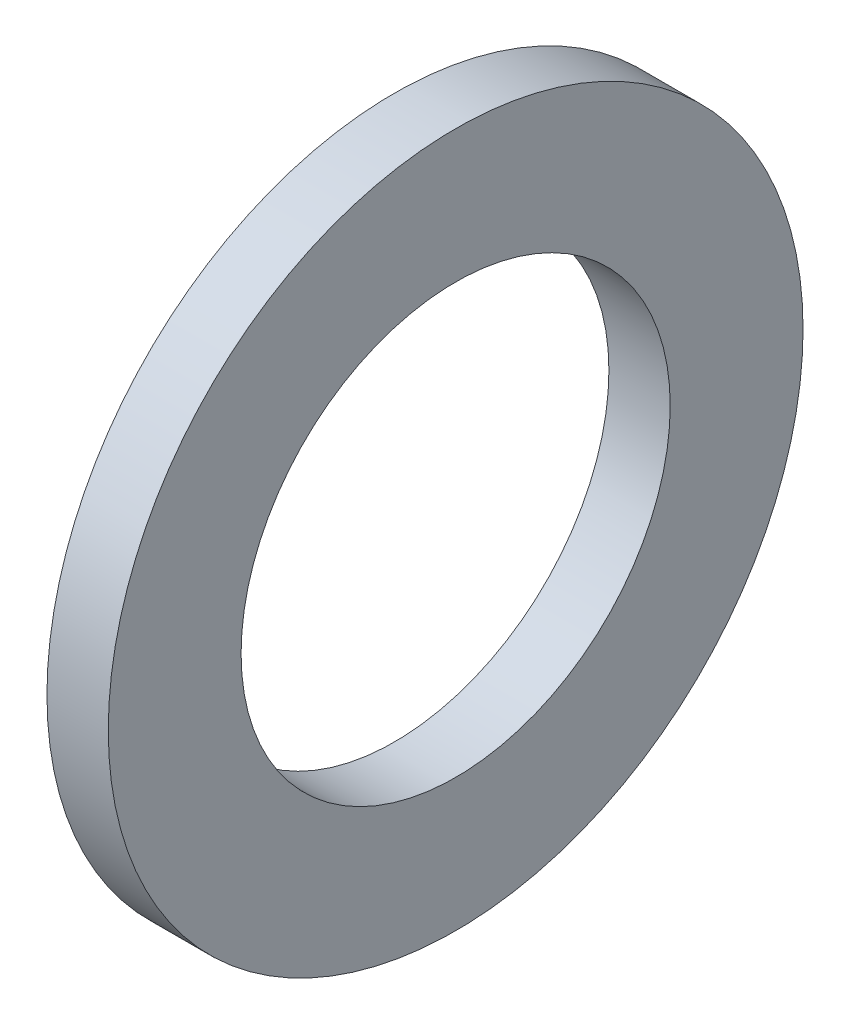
ISO-10303-21;
HEADER;
FILE_DESCRIPTION(('STEP AP214'),'2;1');
FILE_NAME('part.step','',(''),(''),'','','');
FILE_SCHEMA(('AUTOMOTIVE_DESIGN { 1 0 10303 214 1 1 1 1 }'));
ENDSEC;
DATA;
#1=APPLICATION_CONTEXT('core data for automotive mechanical design processes');
#2=APPLICATION_PROTOCOL_DEFINITION('international standard','automotive_design',2000,#1);
#3=PRODUCT_CONTEXT('',#1,'mechanical');
#4=PRODUCT('Part','Part','',(#3));
#5=PRODUCT_RELATED_PRODUCT_CATEGORY('part','',(#4));
#6=PRODUCT_DEFINITION_FORMATION('','',#4);
#7=PRODUCT_DEFINITION_CONTEXT('part definition',#1,'design');
#8=PRODUCT_DEFINITION('design','',#6,#7);
#9=PRODUCT_DEFINITION_SHAPE('','',#8);
#10=(LENGTH_UNIT() NAMED_UNIT(*) SI_UNIT(.MILLI.,.METRE.));
#11=(NAMED_UNIT(*) PLANE_ANGLE_UNIT() SI_UNIT($,.RADIAN.));
#12=(NAMED_UNIT(*) SI_UNIT($,.STERADIAN.) SOLID_ANGLE_UNIT());
#13=UNCERTAINTY_MEASURE_WITH_UNIT(LENGTH_MEASURE(1.E-05),#10,'distance_accuracy_value','');
#14=(GEOMETRIC_REPRESENTATION_CONTEXT(3) GLOBAL_UNCERTAINTY_ASSIGNED_CONTEXT((#13)) GLOBAL_UNIT_ASSIGNED_CONTEXT((#10,
#11,#12)) REPRESENTATION_CONTEXT('',''));
#15=CARTESIAN_POINT('',(0.,0.,0.));
#16=DIRECTION('',(0.,0.,1.));
#17=DIRECTION('',(1.,0.,0.));
#18=AXIS2_PLACEMENT_3D('',#15,#16,#17);
#19=CARTESIAN_POINT('',(-34.9249999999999,0.,0.));
#20=DIRECTION('',(-1.,0.,0.));
#21=DIRECTION('',(0.,0.,1.));
#22=AXIS2_PLACEMENT_3D('',#19,#20,#21);
#23=CYLINDRICAL_SURFACE('',#22,10.5);
#24=CARTESIAN_POINT('',(0.,0.,0.));
#25=DIRECTION('',(-1.,0.,0.));
#26=DIRECTION('',(0.,0.,1.));
#27=AXIS2_PLACEMENT_3D('',#24,#25,#26);
#28=CIRCLE('',#27,10.5);
#29=CARTESIAN_POINT('',(0.,0.,10.5));
#30=VERTEX_POINT('',#29);
#31=EDGE_CURVE('E10',#30,#30,#28,.T.);
#32=ORIENTED_EDGE('',*,*,#31,.F.);
#33=EDGE_LOOP('',(#32));
#34=FACE_BOUND('',#33,.T.);
#35=CARTESIAN_POINT('',(-3.,0.,0.));
#36=DIRECTION('',(-1.,0.,0.));
#37=DIRECTION('',(0.,0.,1.));
#38=AXIS2_PLACEMENT_3D('',#35,#36,#37);
#39=CIRCLE('',#38,10.5);
#40=CARTESIAN_POINT('',(-3.,0.,10.5));
#41=VERTEX_POINT('',#40);
#42=EDGE_CURVE('E45',#41,#41,#39,.T.);
#43=ORIENTED_EDGE('',*,*,#42,.T.);
#44=EDGE_LOOP('',(#43));
#45=FACE_BOUND('',#44,.T.);
#46=ADVANCED_FACE('F31',(#34,#45),#23,.F.);
#47=CARTESIAN_POINT('',(0.,10.5,0.));
#48=DIRECTION('',(-1.,0.,0.));
#49=DIRECTION('',(0.,0.,1.));
#50=AXIS2_PLACEMENT_3D('',#47,#48,#49);
#51=PLANE('',#50);
#52=CARTESIAN_POINT('',(0.,0.,0.));
#53=DIRECTION('',(-1.,0.,0.));
#54=DIRECTION('',(0.,0.,1.));
#55=AXIS2_PLACEMENT_3D('',#52,#53,#54);
#56=CIRCLE('',#55,17.);
#57=CARTESIAN_POINT('',(0.,0.,17.));
#58=VERTEX_POINT('',#57);
#59=EDGE_CURVE('E37',#58,#58,#56,.T.);
#60=ORIENTED_EDGE('',*,*,#59,.F.);
#61=EDGE_LOOP('',(#60));
#62=FACE_BOUND('',#61,.T.);
#63=ORIENTED_EDGE('',*,*,#31,.T.);
#64=EDGE_LOOP('',(#63));
#65=FACE_BOUND('',#64,.T.);
#66=ADVANCED_FACE('F60',(#62,#65),#51,.F.);
#67=CARTESIAN_POINT('',(-34.9249999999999,0.,0.));
#68=DIRECTION('',(-1.,0.,0.));
#69=DIRECTION('',(0.,0.,1.));
#70=AXIS2_PLACEMENT_3D('',#67,#68,#69);
#71=CYLINDRICAL_SURFACE('',#70,17.);
#72=CARTESIAN_POINT('',(-3.,0.,0.));
#73=DIRECTION('',(-1.,0.,0.));
#74=DIRECTION('',(0.,0.,1.));
#75=AXIS2_PLACEMENT_3D('',#72,#73,#74);
#76=CIRCLE('',#75,17.);
#77=CARTESIAN_POINT('',(-3.,0.,17.));
#78=VERTEX_POINT('',#77);
#79=EDGE_CURVE('E41',#78,#78,#76,.T.);
#80=ORIENTED_EDGE('',*,*,#79,.F.);
#81=EDGE_LOOP('',(#80));
#82=FACE_BOUND('',#81,.T.);
#83=ORIENTED_EDGE('',*,*,#59,.T.);
#84=EDGE_LOOP('',(#83));
#85=FACE_BOUND('',#84,.T.);
#86=ADVANCED_FACE('F55',(#82,#85),#71,.T.);
#87=CARTESIAN_POINT('',(-3.,17.,0.));
#88=DIRECTION('',(1.,0.,0.));
#89=DIRECTION('',(0.,0.,-1.));
#90=AXIS2_PLACEMENT_3D('',#87,#88,#89);
#91=PLANE('',#90);
#92=ORIENTED_EDGE('',*,*,#42,.F.);
#93=EDGE_LOOP('',(#92));
#94=FACE_BOUND('',#93,.T.);
#95=ORIENTED_EDGE('',*,*,#79,.T.);
#96=EDGE_LOOP('',(#95));
#97=FACE_BOUND('',#96,.T.);
#98=ADVANCED_FACE('F52',(#94,#97),#91,.F.);
#99=CLOSED_SHELL('',(#46,#66,#86,#98));
#100=MANIFOLD_SOLID_BREP('B2',#99);
#101=ADVANCED_BREP_SHAPE_REPRESENTATION('',(#18,#100),#14);
#102=SHAPE_DEFINITION_REPRESENTATION(#9,#101);
ENDSEC;
END-ISO-10303-21;
